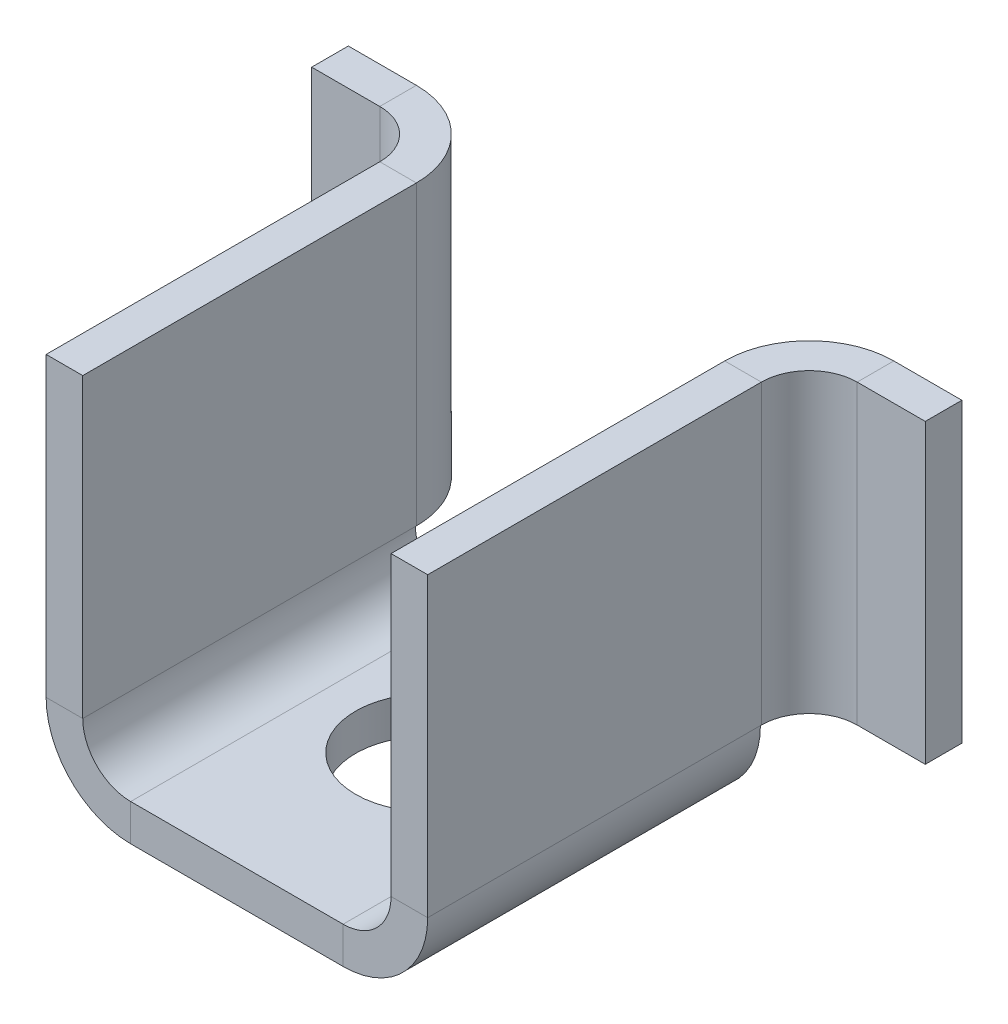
ISO-10303-21;
HEADER;
FILE_DESCRIPTION(('STEP AP214'),'2;1');
FILE_NAME('part.step','',(''),(''),'','','');
FILE_SCHEMA(('AUTOMOTIVE_DESIGN { 1 0 10303 214 1 1 1 1 }'));
ENDSEC;
DATA;
#1=APPLICATION_CONTEXT('core data for automotive mechanical design processes');
#2=APPLICATION_PROTOCOL_DEFINITION('international standard','automotive_design',2000,#1);
#3=PRODUCT_CONTEXT('',#1,'mechanical');
#4=PRODUCT('Part','Part','',(#3));
#5=PRODUCT_RELATED_PRODUCT_CATEGORY('part','',(#4));
#6=PRODUCT_DEFINITION_FORMATION('','',#4);
#7=PRODUCT_DEFINITION_CONTEXT('part definition',#1,'design');
#8=PRODUCT_DEFINITION('design','',#6,#7);
#9=PRODUCT_DEFINITION_SHAPE('','',#8);
#10=(LENGTH_UNIT() NAMED_UNIT(*) SI_UNIT(.MILLI.,.METRE.));
#11=(NAMED_UNIT(*) PLANE_ANGLE_UNIT() SI_UNIT($,.RADIAN.));
#12=(NAMED_UNIT(*) SI_UNIT($,.STERADIAN.) SOLID_ANGLE_UNIT());
#13=UNCERTAINTY_MEASURE_WITH_UNIT(LENGTH_MEASURE(1.E-05),#10,'distance_accuracy_value','');
#14=(GEOMETRIC_REPRESENTATION_CONTEXT(3) GLOBAL_UNCERTAINTY_ASSIGNED_CONTEXT((#13)) GLOBAL_UNIT_ASSIGNED_CONTEXT((#10,
#11,#12)) REPRESENTATION_CONTEXT('',''));
#15=CARTESIAN_POINT('',(0.,0.,0.));
#16=DIRECTION('',(0.,0.,1.));
#17=DIRECTION('',(1.,0.,0.));
#18=AXIS2_PLACEMENT_3D('',#15,#16,#17);
#19=CARTESIAN_POINT('',(-8.83920000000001,3.98780000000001,15.875));
#20=DIRECTION('',(0.,0.,1.));
#21=DIRECTION('',(-1.,0.,0.));
#22=AXIS2_PLACEMENT_3D('',#19,#20,#21);
#23=CYLINDRICAL_SURFACE('',#22,7.03579999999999);
#24=CARTESIAN_POINT('',(-8.83920000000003,3.98780000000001,-11.811));
#25=DIRECTION('',(0.,0.,1.));
#26=DIRECTION('',(1.,0.,0.));
#27=AXIS2_PLACEMENT_3D('',#24,#25,#26);
#28=CIRCLE('',#27,7.0358);
#29=CARTESIAN_POINT('',(-15.875,3.98780000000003,-11.811));
#30=VERTEX_POINT('',#29);
#31=CARTESIAN_POINT('',(-8.83920000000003,-3.048,-11.811));
#32=VERTEX_POINT('',#31);
#33=EDGE_CURVE('E436',#30,#32,#28,.T.);
#34=ORIENTED_EDGE('',*,*,#33,.T.);
#35=DIRECTION('',(0.,0.,1.));
#36=VECTOR('',#35,1.);
#37=CARTESIAN_POINT('',(-8.83920000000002,-3.04799999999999,15.875));
#38=LINE('',#37,#36);
#39=CARTESIAN_POINT('',(-8.83920000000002,-3.04799999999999,15.875));
#40=VERTEX_POINT('',#39);
#41=EDGE_CURVE('E274',#40,#32,#38,.F.);
#42=ORIENTED_EDGE('',*,*,#41,.F.);
#43=CARTESIAN_POINT('',(-8.83920000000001,3.98780000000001,15.875));
#44=DIRECTION('',(0.,0.,1.));
#45=DIRECTION('',(1.,0.,0.));
#46=AXIS2_PLACEMENT_3D('',#43,#44,#45);
#47=CIRCLE('',#46,7.03579999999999);
#48=CARTESIAN_POINT('',(-15.875,3.98779999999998,15.875));
#49=VERTEX_POINT('',#48);
#50=EDGE_CURVE('E317',#49,#40,#47,.T.);
#51=ORIENTED_EDGE('',*,*,#50,.F.);
#52=DIRECTION('',(0.,0.,1.));
#53=VECTOR('',#52,1.);
#54=CARTESIAN_POINT('',(-15.875,3.98779999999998,-15.875));
#55=LINE('',#54,#53);
#56=EDGE_CURVE('E307',#49,#30,#55,.F.);
#57=ORIENTED_EDGE('',*,*,#56,.T.);
#58=EDGE_LOOP('',(#34,#42,#51,#57));
#59=FACE_BOUND('',#58,.T.);
#60=ADVANCED_FACE('F76',(#59),#23,.T.);
#61=CARTESIAN_POINT('',(-8.83920000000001,3.98780000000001,15.875));
#62=DIRECTION('',(0.,0.,1.));
#63=DIRECTION('',(-1.,0.,0.));
#64=AXIS2_PLACEMENT_3D('',#61,#62,#63);
#65=CYLINDRICAL_SURFACE('',#64,3.98779999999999);
#66=DIRECTION('',(0.,0.,1.));
#67=VECTOR('',#66,1.);
#68=CARTESIAN_POINT('',(-8.83920000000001,0.,15.875));
#69=LINE('',#68,#67);
#70=CARTESIAN_POINT('',(-8.83920000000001,0.,15.875));
#71=VERTEX_POINT('',#70);
#72=CARTESIAN_POINT('',(-8.83920000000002,0.,-11.811));
#73=VERTEX_POINT('',#72);
#74=EDGE_CURVE('E320',#71,#73,#69,.F.);
#75=ORIENTED_EDGE('',*,*,#74,.T.);
#76=CARTESIAN_POINT('',(-8.83920000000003,3.98780000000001,-11.811));
#77=DIRECTION('',(0.,0.,-1.));
#78=DIRECTION('',(-1.,0.,0.));
#79=AXIS2_PLACEMENT_3D('',#76,#77,#78);
#80=CIRCLE('',#79,3.9878);
#81=CARTESIAN_POINT('',(-12.827,3.98780000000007,-11.811));
#82=VERTEX_POINT('',#81);
#83=EDGE_CURVE('E434',#82,#73,#80,.F.);
#84=ORIENTED_EDGE('',*,*,#83,.F.);
#85=DIRECTION('',(0.,0.,1.));
#86=VECTOR('',#85,1.);
#87=CARTESIAN_POINT('',(-12.827,3.98779999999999,-15.875));
#88=LINE('',#87,#86);
#89=CARTESIAN_POINT('',(-12.827,3.98779999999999,15.875));
#90=VERTEX_POINT('',#89);
#91=EDGE_CURVE('E294',#82,#90,#88,.T.);
#92=ORIENTED_EDGE('',*,*,#91,.T.);
#93=CARTESIAN_POINT('',(-8.83920000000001,3.98780000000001,15.875));
#94=DIRECTION('',(0.,0.,1.));
#95=DIRECTION('',(1.,0.,0.));
#96=AXIS2_PLACEMENT_3D('',#93,#94,#95);
#97=CIRCLE('',#96,3.98779999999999);
#98=EDGE_CURVE('E298',#90,#71,#97,.T.);
#99=ORIENTED_EDGE('',*,*,#98,.T.);
#100=EDGE_LOOP('',(#75,#84,#92,#99));
#101=FACE_BOUND('',#100,.T.);
#102=ADVANCED_FACE('F471',(#101),#65,.F.);
#103=CARTESIAN_POINT('',(8.83920000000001,3.9878,-15.875));
#104=DIRECTION('',(0.,0.,-1.));
#105=DIRECTION('',(1.,0.,0.));
#106=AXIS2_PLACEMENT_3D('',#103,#104,#105);
#107=CYLINDRICAL_SURFACE('',#106,7.0358);
#108=DIRECTION('',(0.,0.,-1.));
#109=VECTOR('',#108,1.);
#110=CARTESIAN_POINT('',(8.83920000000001,-3.048,-15.875));
#111=LINE('',#110,#109);
#112=CARTESIAN_POINT('',(8.83920000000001,-3.048,-11.811));
#113=VERTEX_POINT('',#112);
#114=CARTESIAN_POINT('',(8.83920000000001,-3.048,15.875));
#115=VERTEX_POINT('',#114);
#116=EDGE_CURVE('E272',#113,#115,#111,.F.);
#117=ORIENTED_EDGE('',*,*,#116,.F.);
#118=CARTESIAN_POINT('',(8.83920000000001,3.9878,-11.811));
#119=DIRECTION('',(0.,0.,1.));
#120=DIRECTION('',(1.,0.,0.));
#121=AXIS2_PLACEMENT_3D('',#118,#119,#120);
#122=CIRCLE('',#121,7.0358);
#123=CARTESIAN_POINT('',(15.875,3.9878,-11.811));
#124=VERTEX_POINT('',#123);
#125=EDGE_CURVE('E243',#113,#124,#122,.T.);
#126=ORIENTED_EDGE('',*,*,#125,.T.);
#127=DIRECTION('',(0.,0.,-1.));
#128=VECTOR('',#127,1.);
#129=CARTESIAN_POINT('',(15.875,3.98779999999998,15.875));
#130=LINE('',#129,#128);
#131=CARTESIAN_POINT('',(15.875,3.98779999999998,15.875));
#132=VERTEX_POINT('',#131);
#133=EDGE_CURVE('E372',#124,#132,#130,.F.);
#134=ORIENTED_EDGE('',*,*,#133,.T.);
#135=CARTESIAN_POINT('',(8.83920000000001,3.9878,15.875));
#136=DIRECTION('',(0.,0.,-1.));
#137=DIRECTION('',(-1.,0.,0.));
#138=AXIS2_PLACEMENT_3D('',#135,#136,#137);
#139=CIRCLE('',#138,7.0358);
#140=EDGE_CURVE('E278',#115,#132,#139,.F.);
#141=ORIENTED_EDGE('',*,*,#140,.F.);
#142=EDGE_LOOP('',(#117,#126,#134,#141));
#143=FACE_BOUND('',#142,.T.);
#144=ADVANCED_FACE('F276',(#143),#107,.T.);
#145=CARTESIAN_POINT('',(8.83920000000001,3.9878,-15.875));
#146=DIRECTION('',(0.,0.,-1.));
#147=DIRECTION('',(1.,0.,0.));
#148=AXIS2_PLACEMENT_3D('',#145,#146,#147);
#149=CYLINDRICAL_SURFACE('',#148,3.9878);
#150=CARTESIAN_POINT('',(8.83920000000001,3.9878,-11.811));
#151=DIRECTION('',(0.,0.,1.));
#152=DIRECTION('',(1.,0.,0.));
#153=AXIS2_PLACEMENT_3D('',#150,#151,#152);
#154=CIRCLE('',#153,3.9878);
#155=CARTESIAN_POINT('',(8.83920000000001,0.,-11.811));
#156=VERTEX_POINT('',#155);
#157=CARTESIAN_POINT('',(12.827,3.98780000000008,-11.811));
#158=VERTEX_POINT('',#157);
#159=EDGE_CURVE('E449',#156,#158,#154,.T.);
#160=ORIENTED_EDGE('',*,*,#159,.F.);
#161=DIRECTION('',(0.,0.,-1.));
#162=VECTOR('',#161,1.);
#163=CARTESIAN_POINT('',(8.83920000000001,0.,-15.875));
#164=LINE('',#163,#162);
#165=CARTESIAN_POINT('',(8.83920000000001,0.,15.875));
#166=VERTEX_POINT('',#165);
#167=EDGE_CURVE('E285',#156,#166,#164,.F.);
#168=ORIENTED_EDGE('',*,*,#167,.T.);
#169=CARTESIAN_POINT('',(8.83920000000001,3.9878,15.875));
#170=DIRECTION('',(0.,0.,-1.));
#171=DIRECTION('',(-1.,0.,0.));
#172=AXIS2_PLACEMENT_3D('',#169,#170,#171);
#173=CIRCLE('',#172,3.9878);
#174=CARTESIAN_POINT('',(12.827,3.98779999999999,15.875));
#175=VERTEX_POINT('',#174);
#176=EDGE_CURVE('E280',#166,#175,#173,.F.);
#177=ORIENTED_EDGE('',*,*,#176,.T.);
#178=DIRECTION('',(0.,0.,-1.));
#179=VECTOR('',#178,1.);
#180=CARTESIAN_POINT('',(12.827,3.98779999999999,15.875));
#181=LINE('',#180,#179);
#182=EDGE_CURVE('E373',#175,#158,#181,.T.);
#183=ORIENTED_EDGE('',*,*,#182,.T.);
#184=EDGE_LOOP('',(#160,#168,#177,#183));
#185=FACE_BOUND('',#184,.T.);
#186=ADVANCED_FACE('F564',(#185),#149,.F.);
#187=CARTESIAN_POINT('',(0.,-3.048,0.));
#188=DIRECTION('',(0.,-1.,0.));
#189=DIRECTION('',(0.,0.,-1.));
#190=AXIS2_PLACEMENT_3D('',#187,#188,#189);
#191=PLANE('',#190);
#192=CARTESIAN_POINT('',(0.,-3.048,0.));
#193=DIRECTION('',(0.,1.,0.));
#194=DIRECTION('',(0.,0.,1.));
#195=AXIS2_PLACEMENT_3D('',#192,#193,#194);
#196=CIRCLE('',#195,5.999999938);
#197=CARTESIAN_POINT('',(0.,-3.048,5.999999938));
#198=VERTEX_POINT('',#197);
#199=EDGE_CURVE('E328',#198,#198,#196,.T.);
#200=ORIENTED_EDGE('',*,*,#199,.T.);
#201=EDGE_LOOP('',(#200));
#202=FACE_BOUND('',#201,.T.);
#203=ORIENTED_EDGE('',*,*,#41,.T.);
#204=DIRECTION('',(1.,0.,0.));
#205=VECTOR('',#204,1.);
#206=CARTESIAN_POINT('',(0.,-3.048,-11.811));
#207=LINE('',#206,#205);
#208=EDGE_CURVE('E262',#113,#32,#207,.F.);
#209=ORIENTED_EDGE('',*,*,#208,.F.);
#210=ORIENTED_EDGE('',*,*,#116,.T.);
#211=DIRECTION('',(1.,0.,0.));
#212=VECTOR('',#211,1.);
#213=CARTESIAN_POINT('',(15.875,-3.048,15.875));
#214=LINE('',#213,#212);
#215=EDGE_CURVE('E87',#40,#115,#214,.T.);
#216=ORIENTED_EDGE('',*,*,#215,.F.);
#217=EDGE_LOOP('',(#203,#209,#210,#216));
#218=FACE_BOUND('',#217,.T.);
#219=ADVANCED_FACE('F270',(#202,#218),#191,.T.);
#220=CARTESIAN_POINT('',(0.,0.,0.));
#221=DIRECTION('',(0.,-1.,0.));
#222=DIRECTION('',(0.,0.,-1.));
#223=AXIS2_PLACEMENT_3D('',#220,#221,#222);
#224=PLANE('',#223);
#225=CARTESIAN_POINT('',(0.,0.,0.));
#226=DIRECTION('',(0.,1.,0.));
#227=DIRECTION('',(0.,0.,1.));
#228=AXIS2_PLACEMENT_3D('',#225,#226,#227);
#229=CIRCLE('',#228,5.999999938);
#230=CARTESIAN_POINT('',(0.,0.,5.999999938));
#231=VERTEX_POINT('',#230);
#232=EDGE_CURVE('E327',#231,#231,#229,.T.);
#233=ORIENTED_EDGE('',*,*,#232,.F.);
#234=EDGE_LOOP('',(#233));
#235=FACE_BOUND('',#234,.T.);
#236=DIRECTION('',(-1.,0.,0.));
#237=VECTOR('',#236,1.);
#238=CARTESIAN_POINT('',(0.,0.,-11.811));
#239=LINE('',#238,#237);
#240=EDGE_CURVE('E265',#156,#73,#239,.T.);
#241=ORIENTED_EDGE('',*,*,#240,.T.);
#242=ORIENTED_EDGE('',*,*,#74,.F.);
#243=DIRECTION('',(1.,0.,0.));
#244=VECTOR('',#243,1.);
#245=CARTESIAN_POINT('',(15.875,0.,15.875));
#246=LINE('',#245,#244);
#247=EDGE_CURVE('E331',#71,#166,#246,.T.);
#248=ORIENTED_EDGE('',*,*,#247,.T.);
#249=ORIENTED_EDGE('',*,*,#167,.F.);
#250=EDGE_LOOP('',(#241,#242,#248,#249));
#251=FACE_BOUND('',#250,.T.);
#252=ADVANCED_FACE('F467',(#235,#251),#224,.F.);
#253=CARTESIAN_POINT('',(15.875,0.,0.));
#254=DIRECTION('',(-1.,0.,0.));
#255=DIRECTION('',(0.,-1.,0.));
#256=AXIS2_PLACEMENT_3D('',#253,#254,#255);
#257=PLANE('',#256);
#258=DIRECTION('',(0.,1.,0.));
#259=VECTOR('',#258,1.);
#260=CARTESIAN_POINT('',(15.8750000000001,28.702,-11.8872));
#261=LINE('',#260,#259);
#262=CARTESIAN_POINT('',(15.8750000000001,28.702,-11.8872));
#263=VERTEX_POINT('',#262);
#264=CARTESIAN_POINT('',(15.875,3.98780000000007,-11.8872));
#265=VERTEX_POINT('',#264);
#266=EDGE_CURVE('E588',#263,#265,#261,.F.);
#267=ORIENTED_EDGE('',*,*,#266,.F.);
#268=DIRECTION('',(0.,0.,1.));
#269=VECTOR('',#268,1.);
#270=CARTESIAN_POINT('',(15.8750000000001,28.702,0.));
#271=LINE('',#270,#269);
#272=CARTESIAN_POINT('',(15.8750000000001,28.702,15.875));
#273=VERTEX_POINT('',#272);
#274=EDGE_CURVE('E361',#263,#273,#271,.T.);
#275=ORIENTED_EDGE('',*,*,#274,.T.);
#276=DIRECTION('',(0.,-1.,0.));
#277=VECTOR('',#276,1.);
#278=CARTESIAN_POINT('',(15.875,0.,15.875));
#279=LINE('',#278,#277);
#280=EDGE_CURVE('E363',#273,#132,#279,.T.);
#281=ORIENTED_EDGE('',*,*,#280,.T.);
#282=ORIENTED_EDGE('',*,*,#133,.F.);
#283=EDGE_CURVE('E371',#265,#124,#130,.F.);
#284=ORIENTED_EDGE('',*,*,#283,.F.);
#285=EDGE_LOOP('',(#267,#275,#281,#282,#284));
#286=FACE_BOUND('',#285,.T.);
#287=ADVANCED_FACE('F647',(#286),#257,.F.);
#288=CARTESIAN_POINT('',(12.827,0.,0.));
#289=DIRECTION('',(-1.,0.,0.));
#290=DIRECTION('',(0.,-1.,0.));
#291=AXIS2_PLACEMENT_3D('',#288,#289,#290);
#292=PLANE('',#291);
#293=DIRECTION('',(0.,0.,-1.));
#294=VECTOR('',#293,1.);
#295=CARTESIAN_POINT('',(12.8270000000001,28.702,15.875));
#296=LINE('',#295,#294);
#297=CARTESIAN_POINT('',(12.8270000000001,28.702,-11.8872));
#298=VERTEX_POINT('',#297);
#299=CARTESIAN_POINT('',(12.8270000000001,28.702,15.875));
#300=VERTEX_POINT('',#299);
#301=EDGE_CURVE('E366',#298,#300,#296,.F.);
#302=ORIENTED_EDGE('',*,*,#301,.F.);
#303=DIRECTION('',(0.,1.,0.));
#304=VECTOR('',#303,1.);
#305=CARTESIAN_POINT('',(12.8270000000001,28.702,-11.8872));
#306=LINE('',#305,#304);
#307=CARTESIAN_POINT('',(12.827,3.98780000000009,-11.8872));
#308=VERTEX_POINT('',#307);
#309=EDGE_CURVE('E574',#298,#308,#306,.F.);
#310=ORIENTED_EDGE('',*,*,#309,.T.);
#311=DIRECTION('',(0.,0.,-1.));
#312=VECTOR('',#311,1.);
#313=CARTESIAN_POINT('',(12.827,3.98780000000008,-15.875));
#314=LINE('',#313,#312);
#315=EDGE_CURVE('E419',#308,#158,#314,.F.);
#316=ORIENTED_EDGE('',*,*,#315,.T.);
#317=ORIENTED_EDGE('',*,*,#182,.F.);
#318=DIRECTION('',(0.,1.,0.));
#319=VECTOR('',#318,1.);
#320=CARTESIAN_POINT('',(12.827,0.,15.875));
#321=LINE('',#320,#319);
#322=EDGE_CURVE('E368',#300,#175,#321,.F.);
#323=ORIENTED_EDGE('',*,*,#322,.F.);
#324=EDGE_LOOP('',(#302,#310,#316,#317,#323));
#325=FACE_BOUND('',#324,.T.);
#326=ADVANCED_FACE('F567',(#325),#292,.T.);
#327=CARTESIAN_POINT('',(15.8750000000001,28.702,15.875));
#328=DIRECTION('',(0.,-1.,0.));
#329=DIRECTION('',(1.,0.,0.));
#330=AXIS2_PLACEMENT_3D('',#327,#328,#329);
#331=PLANE('',#330);
#332=DIRECTION('',(-1.,0.,0.));
#333=VECTOR('',#332,1.);
#334=CARTESIAN_POINT('',(15.8750000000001,28.702,-11.8872));
#335=LINE('',#334,#333);
#336=EDGE_CURVE('E510',#263,#298,#335,.T.);
#337=ORIENTED_EDGE('',*,*,#336,.T.);
#338=ORIENTED_EDGE('',*,*,#301,.T.);
#339=DIRECTION('',(-1.,0.,0.));
#340=VECTOR('',#339,1.);
#341=CARTESIAN_POINT('',(15.8750000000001,28.702,15.875));
#342=LINE('',#341,#340);
#343=EDGE_CURVE('E292',#273,#300,#342,.T.);
#344=ORIENTED_EDGE('',*,*,#343,.F.);
#345=ORIENTED_EDGE('',*,*,#274,.F.);
#346=EDGE_LOOP('',(#337,#338,#344,#345));
#347=FACE_BOUND('',#346,.T.);
#348=ADVANCED_FACE('F572',(#347),#331,.F.);
#349=CARTESIAN_POINT('',(-15.875,0.,0.));
#350=DIRECTION('',(1.,0.,0.));
#351=DIRECTION('',(0.,1.,0.));
#352=AXIS2_PLACEMENT_3D('',#349,#350,#351);
#353=PLANE('',#352);
#354=DIRECTION('',(0.,-1.,0.));
#355=VECTOR('',#354,1.);
#356=CARTESIAN_POINT('',(-15.875,3.98779999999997,-11.8872));
#357=LINE('',#356,#355);
#358=CARTESIAN_POINT('',(-15.875,3.98780000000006,-11.8872));
#359=VERTEX_POINT('',#358);
#360=CARTESIAN_POINT('',(-15.8750000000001,28.702,-11.8872));
#361=VERTEX_POINT('',#360);
#362=EDGE_CURVE('E350',#359,#361,#357,.F.);
#363=ORIENTED_EDGE('',*,*,#362,.F.);
#364=DIRECTION('',(0.,0.,1.));
#365=VECTOR('',#364,1.);
#366=CARTESIAN_POINT('',(-15.875,3.98780000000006,15.875));
#367=LINE('',#366,#365);
#368=EDGE_CURVE('E447',#30,#359,#367,.F.);
#369=ORIENTED_EDGE('',*,*,#368,.F.);
#370=ORIENTED_EDGE('',*,*,#56,.F.);
#371=DIRECTION('',(0.,1.,0.));
#372=VECTOR('',#371,1.);
#373=CARTESIAN_POINT('',(-15.875,0.,15.875));
#374=LINE('',#373,#372);
#375=CARTESIAN_POINT('',(-15.8750000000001,28.702,15.875));
#376=VERTEX_POINT('',#375);
#377=EDGE_CURVE('E301',#49,#376,#374,.T.);
#378=ORIENTED_EDGE('',*,*,#377,.T.);
#379=DIRECTION('',(0.,0.,-1.));
#380=VECTOR('',#379,1.);
#381=CARTESIAN_POINT('',(-15.8750000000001,28.702,0.));
#382=LINE('',#381,#380);
#383=EDGE_CURVE('E299',#376,#361,#382,.T.);
#384=ORIENTED_EDGE('',*,*,#383,.T.);
#385=EDGE_LOOP('',(#363,#369,#370,#378,#384));
#386=FACE_BOUND('',#385,.T.);
#387=ADVANCED_FACE('F492',(#386),#353,.F.);
#388=CARTESIAN_POINT('',(-12.827,0.,0.));
#389=DIRECTION('',(1.,0.,0.));
#390=DIRECTION('',(0.,1.,0.));
#391=AXIS2_PLACEMENT_3D('',#388,#389,#390);
#392=PLANE('',#391);
#393=CARTESIAN_POINT('',(-12.827,3.98780000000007,-11.8872));
#394=VERTEX_POINT('',#393);
#395=EDGE_CURVE('E313',#394,#82,#88,.T.);
#396=ORIENTED_EDGE('',*,*,#395,.F.);
#397=DIRECTION('',(0.,-1.,0.));
#398=VECTOR('',#397,1.);
#399=CARTESIAN_POINT('',(-12.827,3.98779999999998,-11.8872));
#400=LINE('',#399,#398);
#401=CARTESIAN_POINT('',(-12.8270000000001,28.702,-11.8872));
#402=VERTEX_POINT('',#401);
#403=EDGE_CURVE('E349',#394,#402,#400,.F.);
#404=ORIENTED_EDGE('',*,*,#403,.T.);
#405=DIRECTION('',(0.,0.,1.));
#406=VECTOR('',#405,1.);
#407=CARTESIAN_POINT('',(-12.8270000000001,28.702,-15.875));
#408=LINE('',#407,#406);
#409=CARTESIAN_POINT('',(-12.8270000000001,28.702,15.875));
#410=VERTEX_POINT('',#409);
#411=EDGE_CURVE('E303',#410,#402,#408,.F.);
#412=ORIENTED_EDGE('',*,*,#411,.F.);
#413=DIRECTION('',(0.,-1.,0.));
#414=VECTOR('',#413,1.);
#415=CARTESIAN_POINT('',(-12.8270000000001,28.702,15.875));
#416=LINE('',#415,#414);
#417=EDGE_CURVE('E305',#90,#410,#416,.F.);
#418=ORIENTED_EDGE('',*,*,#417,.F.);
#419=ORIENTED_EDGE('',*,*,#91,.F.);
#420=EDGE_LOOP('',(#396,#404,#412,#418,#419));
#421=FACE_BOUND('',#420,.T.);
#422=ADVANCED_FACE('F486',(#421),#392,.T.);
#423=CARTESIAN_POINT('',(-15.8750000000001,28.702,-15.875));
#424=DIRECTION('',(0.,-1.,0.));
#425=DIRECTION('',(1.,0.,0.));
#426=AXIS2_PLACEMENT_3D('',#423,#424,#425);
#427=PLANE('',#426);
#428=DIRECTION('',(1.,0.,0.));
#429=VECTOR('',#428,1.);
#430=CARTESIAN_POINT('',(-15.8750000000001,28.702,-11.8872));
#431=LINE('',#430,#429);
#432=EDGE_CURVE('E104',#361,#402,#431,.T.);
#433=ORIENTED_EDGE('',*,*,#432,.F.);
#434=ORIENTED_EDGE('',*,*,#383,.F.);
#435=DIRECTION('',(1.,0.,0.));
#436=VECTOR('',#435,1.);
#437=CARTESIAN_POINT('',(-15.8750000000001,28.702,15.875));
#438=LINE('',#437,#436);
#439=EDGE_CURVE('E295',#376,#410,#438,.T.);
#440=ORIENTED_EDGE('',*,*,#439,.T.);
#441=ORIENTED_EDGE('',*,*,#411,.T.);
#442=EDGE_LOOP('',(#433,#434,#440,#441));
#443=FACE_BOUND('',#442,.T.);
#444=ADVANCED_FACE('F489',(#443),#427,.F.);
#445=CARTESIAN_POINT('',(15.875,-3.048,15.875));
#446=DIRECTION('',(0.,0.,1.));
#447=DIRECTION('',(1.,0.,0.));
#448=AXIS2_PLACEMENT_3D('',#445,#446,#447);
#449=PLANE('',#448);
#450=DIRECTION('',(0.,-1.,0.));
#451=VECTOR('',#450,1.);
#452=CARTESIAN_POINT('',(8.83920000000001,0.,15.875));
#453=LINE('',#452,#451);
#454=EDGE_CURVE('E282',#166,#115,#453,.T.);
#455=ORIENTED_EDGE('',*,*,#454,.F.);
#456=ORIENTED_EDGE('',*,*,#247,.F.);
#457=DIRECTION('',(0.,-1.,0.));
#458=VECTOR('',#457,1.);
#459=CARTESIAN_POINT('',(-8.83920000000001,0.,15.875));
#460=LINE('',#459,#458);
#461=EDGE_CURVE('E316',#71,#40,#460,.T.);
#462=ORIENTED_EDGE('',*,*,#461,.T.);
#463=ORIENTED_EDGE('',*,*,#215,.T.);
#464=EDGE_LOOP('',(#455,#456,#462,#463));
#465=FACE_BOUND('',#464,.T.);
#466=ADVANCED_FACE('F78',(#465),#449,.T.);
#467=CARTESIAN_POINT('',(0.,-3.048,0.));
#468=DIRECTION('',(0.,1.,0.));
#469=DIRECTION('',(0.,0.,1.));
#470=AXIS2_PLACEMENT_3D('',#467,#468,#469);
#471=CYLINDRICAL_SURFACE('',#470,5.999999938);
#472=CARTESIAN_POINT('',(0.,-3.048,5.999999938));
#473=CARTESIAN_POINT('',(0.,-3.01625,5.999999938));
#474=CARTESIAN_POINT('',(0.,-2.9845,5.999999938));
#475=CARTESIAN_POINT('',(0.,-2.921,5.999999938));
#476=CARTESIAN_POINT('',(0.,-2.88925,5.999999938));
#477=CARTESIAN_POINT('',(0.,-2.82575,5.999999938));
#478=CARTESIAN_POINT('',(0.,-2.794,5.999999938));
#479=CARTESIAN_POINT('',(0.,-2.7305,5.999999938));
#480=CARTESIAN_POINT('',(0.,-2.69875,5.999999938));
#481=CARTESIAN_POINT('',(0.,-2.63525,5.999999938));
#482=CARTESIAN_POINT('',(0.,-2.6035,5.999999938));
#483=CARTESIAN_POINT('',(0.,-2.54,5.999999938));
#484=CARTESIAN_POINT('',(0.,-2.50825,5.999999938));
#485=CARTESIAN_POINT('',(0.,-2.44475,5.999999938));
#486=CARTESIAN_POINT('',(0.,-2.413,5.999999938));
#487=CARTESIAN_POINT('',(0.,-2.3495,5.999999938));
#488=CARTESIAN_POINT('',(0.,-2.31775,5.999999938));
#489=CARTESIAN_POINT('',(0.,-2.25425,5.999999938));
#490=CARTESIAN_POINT('',(0.,-2.2225,5.999999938));
#491=CARTESIAN_POINT('',(0.,-2.159,5.999999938));
#492=CARTESIAN_POINT('',(0.,-2.12725,5.999999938));
#493=CARTESIAN_POINT('',(0.,-2.06375,5.999999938));
#494=CARTESIAN_POINT('',(0.,-2.032,5.999999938));
#495=CARTESIAN_POINT('',(0.,-1.9685,5.999999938));
#496=CARTESIAN_POINT('',(0.,-1.93675,5.999999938));
#497=CARTESIAN_POINT('',(0.,-1.87325,5.999999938));
#498=CARTESIAN_POINT('',(0.,-1.8415,5.999999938));
#499=CARTESIAN_POINT('',(0.,-1.778,5.999999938));
#500=CARTESIAN_POINT('',(0.,-1.74625,5.999999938));
#501=CARTESIAN_POINT('',(0.,-1.68275,5.999999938));
#502=CARTESIAN_POINT('',(0.,-1.651,5.999999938));
#503=CARTESIAN_POINT('',(0.,-1.5875,5.999999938));
#504=CARTESIAN_POINT('',(0.,-1.55575,5.999999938));
#505=CARTESIAN_POINT('',(0.,-1.49225,5.999999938));
#506=CARTESIAN_POINT('',(0.,-1.4605,5.999999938));
#507=CARTESIAN_POINT('',(0.,-1.397,5.999999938));
#508=CARTESIAN_POINT('',(0.,-1.36525,5.999999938));
#509=CARTESIAN_POINT('',(0.,-1.30175,5.999999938));
#510=CARTESIAN_POINT('',(0.,-1.27,5.999999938));
#511=CARTESIAN_POINT('',(0.,-1.2065,5.999999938));
#512=CARTESIAN_POINT('',(0.,-1.17475,5.999999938));
#513=CARTESIAN_POINT('',(0.,-1.11125,5.999999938));
#514=CARTESIAN_POINT('',(0.,-1.0795,5.999999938));
#515=CARTESIAN_POINT('',(0.,-1.016,5.999999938));
#516=CARTESIAN_POINT('',(0.,-0.98425,5.999999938));
#517=CARTESIAN_POINT('',(0.,-0.92075,5.999999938));
#518=CARTESIAN_POINT('',(0.,-0.889,5.999999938));
#519=CARTESIAN_POINT('',(0.,-0.8255,5.999999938));
#520=CARTESIAN_POINT('',(0.,-0.79375,5.999999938));
#521=CARTESIAN_POINT('',(0.,-0.73025,5.999999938));
#522=CARTESIAN_POINT('',(0.,-0.6985,5.999999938));
#523=CARTESIAN_POINT('',(0.,-0.635,5.999999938));
#524=CARTESIAN_POINT('',(0.,-0.60325,5.999999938));
#525=CARTESIAN_POINT('',(0.,-0.53975,5.999999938));
#526=CARTESIAN_POINT('',(0.,-0.508,5.999999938));
#527=CARTESIAN_POINT('',(0.,-0.4445,5.999999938));
#528=CARTESIAN_POINT('',(0.,-0.41275,5.999999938));
#529=CARTESIAN_POINT('',(0.,-0.34925,5.999999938));
#530=CARTESIAN_POINT('',(0.,-0.3175,5.999999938));
#531=CARTESIAN_POINT('',(0.,-0.254,5.999999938));
#532=CARTESIAN_POINT('',(0.,-0.22225,5.999999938));
#533=CARTESIAN_POINT('',(0.,-0.15875,5.999999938));
#534=CARTESIAN_POINT('',(0.,-0.127,5.999999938));
#535=CARTESIAN_POINT('',(0.,-0.0634999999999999,5.999999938));
#536=CARTESIAN_POINT('',(0.,-0.03175,5.999999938));
#537=CARTESIAN_POINT('',(0.,0.,5.999999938));
#538=B_SPLINE_CURVE_WITH_KNOTS('',3,(#472,#473,#474,#475,#476,#477,#478,#479,#480,#481,#482,
#483,#484,#485,#486,#487,#488,#489,#490,#491,#492,#493,#494,#495,#496,#497,#498,#499,#500,#501,
#502,#503,#504,#505,#506,#507,#508,#509,#510,#511,#512,#513,#514,#515,#516,#517,#518,#519,#520,
#521,#522,#523,#524,#525,#526,#527,#528,#529,#530,#531,#532,#533,#534,#535,#536,#537),
.UNSPECIFIED.,.F.,.F.,(4,2,2,2,2,2,2,2,2,2,2,2,2,2,2,2,2,2,2,2,2,2,2,2,2,2,2,2,2,2,2,2,4),(0.,
0.0952499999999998,0.1905,0.28575,0.381,0.47625,0.5715,0.66675,0.762,0.85725,0.9525,1.04775,
1.143,1.23825,1.3335,1.42875,1.524,1.61925,1.7145,1.80975,1.905,2.00025,2.0955,2.19075,2.286,
2.38125,2.4765,2.57175,2.667,2.76225,2.8575,2.95275,3.048),.UNSPECIFIED.);
#539=EDGE_CURVE('BSEAM669',#198,#231,#538,.T.);
#540=ORIENTED_EDGE('',*,*,#199,.F.);
#541=ORIENTED_EDGE('',*,*,#232,.T.);
#542=ORIENTED_EDGE('',*,*,#539,.T.);
#543=ORIENTED_EDGE('',*,*,#539,.F.);
#544=EDGE_LOOP('',(#540,#542,#541,#543));
#545=FACE_BOUND('',#544,.T.);
#546=ADVANCED_FACE('F669',(#545),#471,.F.);
#547=CARTESIAN_POINT('',(-8.83920000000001,3.98780000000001,15.875));
#548=DIRECTION('',(0.,0.,-1.));
#549=DIRECTION('',(-1.,0.,0.));
#550=AXIS2_PLACEMENT_3D('',#547,#548,#549);
#551=PLANE('',#550);
#552=ORIENTED_EDGE('',*,*,#98,.F.);
#553=DIRECTION('',(1.,0.,0.));
#554=VECTOR('',#553,1.);
#555=CARTESIAN_POINT('',(-12.827,3.98779999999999,15.875));
#556=LINE('',#555,#554);
#557=EDGE_CURVE('E310',#90,#49,#556,.F.);
#558=ORIENTED_EDGE('',*,*,#557,.T.);
#559=ORIENTED_EDGE('',*,*,#50,.T.);
#560=ORIENTED_EDGE('',*,*,#461,.F.);
#561=EDGE_LOOP('',(#552,#558,#559,#560));
#562=FACE_BOUND('',#561,.T.);
#563=ADVANCED_FACE('F476',(#562),#551,.F.);
#564=CARTESIAN_POINT('',(-15.8750000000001,28.702,15.875));
#565=DIRECTION('',(0.,0.,-1.));
#566=DIRECTION('',(-1.,0.,0.));
#567=AXIS2_PLACEMENT_3D('',#564,#565,#566);
#568=PLANE('',#567);
#569=ORIENTED_EDGE('',*,*,#557,.F.);
#570=ORIENTED_EDGE('',*,*,#417,.T.);
#571=ORIENTED_EDGE('',*,*,#439,.F.);
#572=ORIENTED_EDGE('',*,*,#377,.F.);
#573=EDGE_LOOP('',(#569,#570,#571,#572));
#574=FACE_BOUND('',#573,.T.);
#575=ADVANCED_FACE('F481',(#574),#568,.F.);
#576=CARTESIAN_POINT('',(8.83920000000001,3.9878,15.875));
#577=DIRECTION('',(0.,0.,1.));
#578=DIRECTION('',(1.,0.,0.));
#579=AXIS2_PLACEMENT_3D('',#576,#577,#578);
#580=PLANE('',#579);
#581=DIRECTION('',(-1.,0.,0.));
#582=VECTOR('',#581,1.);
#583=CARTESIAN_POINT('',(15.875,3.98779999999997,15.875));
#584=LINE('',#583,#582);
#585=EDGE_CURVE('E288',#175,#132,#584,.F.);
#586=ORIENTED_EDGE('',*,*,#585,.F.);
#587=ORIENTED_EDGE('',*,*,#176,.F.);
#588=ORIENTED_EDGE('',*,*,#454,.T.);
#589=ORIENTED_EDGE('',*,*,#140,.T.);
#590=EDGE_LOOP('',(#586,#587,#588,#589));
#591=FACE_BOUND('',#590,.T.);
#592=ADVANCED_FACE('F563',(#591),#580,.T.);
#593=CARTESIAN_POINT('',(15.875,0.,15.875));
#594=DIRECTION('',(0.,0.,-1.));
#595=DIRECTION('',(-1.,0.,0.));
#596=AXIS2_PLACEMENT_3D('',#593,#594,#595);
#597=PLANE('',#596);
#598=ORIENTED_EDGE('',*,*,#585,.T.);
#599=ORIENTED_EDGE('',*,*,#280,.F.);
#600=ORIENTED_EDGE('',*,*,#343,.T.);
#601=ORIENTED_EDGE('',*,*,#322,.T.);
#602=EDGE_LOOP('',(#598,#599,#600,#601));
#603=FACE_BOUND('',#602,.T.);
#604=ADVANCED_FACE('F568',(#603),#597,.F.);
#605=CARTESIAN_POINT('',(-19.8628000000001,28.702,-11.8872));
#606=DIRECTION('',(0.,1.,0.));
#607=DIRECTION('',(-1.,0.,0.));
#608=AXIS2_PLACEMENT_3D('',#605,#606,#607);
#609=PLANE('',#608);
#610=DIRECTION('',(0.,0.,-1.));
#611=VECTOR('',#610,1.);
#612=CARTESIAN_POINT('',(-19.8628000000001,28.702,-15.875));
#613=LINE('',#612,#611);
#614=CARTESIAN_POINT('',(-19.8628000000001,28.702,-15.875));
#615=VERTEX_POINT('',#614);
#616=CARTESIAN_POINT('',(-19.8628000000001,28.702,-18.923));
#617=VERTEX_POINT('',#616);
#618=EDGE_CURVE('E504',#615,#617,#613,.T.);
#619=ORIENTED_EDGE('',*,*,#618,.F.);
#620=CARTESIAN_POINT('',(-19.8628000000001,28.702,-11.8872));
#621=DIRECTION('',(0.,-1.,0.));
#622=DIRECTION('',(1.,0.,0.));
#623=AXIS2_PLACEMENT_3D('',#620,#621,#622);
#624=CIRCLE('',#623,3.9878);
#625=EDGE_CURVE('E346',#361,#615,#624,.F.);
#626=ORIENTED_EDGE('',*,*,#625,.F.);
#627=ORIENTED_EDGE('',*,*,#432,.T.);
#628=CARTESIAN_POINT('',(-19.8628000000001,28.702,-11.8872));
#629=DIRECTION('',(0.,-1.,0.));
#630=DIRECTION('',(1.,0.,0.));
#631=AXIS2_PLACEMENT_3D('',#628,#629,#630);
#632=CIRCLE('',#631,7.0358);
#633=EDGE_CURVE('E344',#402,#617,#632,.F.);
#634=ORIENTED_EDGE('',*,*,#633,.T.);
#635=EDGE_LOOP('',(#619,#626,#627,#634));
#636=FACE_BOUND('',#635,.T.);
#637=ADVANCED_FACE('F500',(#636),#609,.T.);
#638=CARTESIAN_POINT('',(-19.8628,3.98779999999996,-11.8872));
#639=DIRECTION('',(0.,1.,0.));
#640=DIRECTION('',(-1.,0.,0.));
#641=AXIS2_PLACEMENT_3D('',#638,#639,#640);
#642=PLANE('',#641);
#643=DIRECTION('',(0.,0.,-1.));
#644=VECTOR('',#643,1.);
#645=CARTESIAN_POINT('',(-19.8628,3.98779999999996,-15.875));
#646=LINE('',#645,#644);
#647=CARTESIAN_POINT('',(-19.8628,3.98779999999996,-15.875));
#648=VERTEX_POINT('',#647);
#649=CARTESIAN_POINT('',(-19.8628,3.98779999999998,-18.923));
#650=VERTEX_POINT('',#649);
#651=EDGE_CURVE('E512',#648,#650,#646,.T.);
#652=ORIENTED_EDGE('',*,*,#651,.T.);
#653=CARTESIAN_POINT('',(-19.8628,3.98779999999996,-11.8872));
#654=DIRECTION('',(0.,-1.,0.));
#655=DIRECTION('',(1.,0.,0.));
#656=AXIS2_PLACEMENT_3D('',#653,#654,#655);
#657=CIRCLE('',#656,7.0358);
#658=CARTESIAN_POINT('',(-13.6747137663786,3.98779999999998,-15.2353443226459));
#659=VERTEX_POINT('',#658);
#660=EDGE_CURVE('E13',#650,#659,#657,.T.);
#661=ORIENTED_EDGE('',*,*,#660,.T.);
#662=DIRECTION('',(1.,0.,0.));
#663=VECTOR('',#662,1.);
#664=CARTESIAN_POINT('',(-12.827,3.98780000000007,-15.235344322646));
#665=LINE('',#664,#663);
#666=CARTESIAN_POINT('',(-15.875,3.98780000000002,-15.2353443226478));
#667=VERTEX_POINT('',#666);
#668=EDGE_CURVE('E386',#659,#667,#665,.F.);
#669=ORIENTED_EDGE('',*,*,#668,.T.);
#670=CARTESIAN_POINT('',(-15.875,3.98780000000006,-14.5576458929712));
#671=CARTESIAN_POINT('',(-15.875,3.98964462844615,-14.8206204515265));
#672=CARTESIAN_POINT('',(-15.875,3.99148925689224,-15.0835950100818));
#673=CARTESIAN_POINT('',(-15.875,3.98780000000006,-15.235344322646));
#674=B_SPLINE_CURVE_WITH_KNOTS('',3,(#670,#671,#672,#673),.UNSPECIFIED.,.F.,.F.,(4,4),
(0.835471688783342,1.),.UNSPECIFIED.);
#675=CARTESIAN_POINT('',(-15.875,3.98780000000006,-14.5576458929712));
#676=VERTEX_POINT('',#675);
#677=EDGE_CURVE('E358',#667,#676,#674,.F.);
#678=ORIENTED_EDGE('',*,*,#677,.T.);
#679=DIRECTION('',(1.,0.,0.));
#680=VECTOR('',#679,1.);
#681=CARTESIAN_POINT('',(-12.827,3.98780000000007,-14.5576458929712));
#682=LINE('',#681,#680);
#683=CARTESIAN_POINT('',(-13.3534835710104,3.98779999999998,-14.5576458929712));
#684=VERTEX_POINT('',#683);
#685=EDGE_CURVE('E384',#684,#676,#682,.F.);
#686=ORIENTED_EDGE('',*,*,#685,.F.);
#687=CARTESIAN_POINT('',(-19.8628,3.98779999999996,-11.8872));
#688=DIRECTION('',(0.,1.,0.));
#689=DIRECTION('',(-1.,0.,0.));
#690=AXIS2_PLACEMENT_3D('',#687,#688,#689);
#691=CIRCLE('',#690,7.0358);
#692=EDGE_CURVE('E450',#684,#394,#691,.F.);
#693=ORIENTED_EDGE('',*,*,#692,.T.);
#694=DIRECTION('',(-1.,0.,0.));
#695=VECTOR('',#694,1.);
#696=CARTESIAN_POINT('',(-15.875,3.98780000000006,-11.8872));
#697=LINE('',#696,#695);
#698=EDGE_CURVE('E442',#359,#394,#697,.F.);
#699=ORIENTED_EDGE('',*,*,#698,.F.);
#700=CARTESIAN_POINT('',(-19.8628,3.98779999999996,-11.8872));
#701=DIRECTION('',(0.,-1.,0.));
#702=DIRECTION('',(1.,0.,0.));
#703=AXIS2_PLACEMENT_3D('',#700,#701,#702);
#704=CIRCLE('',#703,3.9878);
#705=EDGE_CURVE('E353',#648,#359,#704,.T.);
#706=ORIENTED_EDGE('',*,*,#705,.F.);
#707=EDGE_LOOP('',(#652,#661,#669,#678,#686,#693,#699,#706));
#708=FACE_BOUND('',#707,.T.);
#709=ADVANCED_FACE('F383',(#708),#642,.F.);
#710=CARTESIAN_POINT('',(-19.8628,3.98779999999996,-11.8872));
#711=DIRECTION('',(0.,-1.,0.));
#712=DIRECTION('',(0.,0.,-1.));
#713=AXIS2_PLACEMENT_3D('',#710,#711,#712);
#714=CYLINDRICAL_SURFACE('',#713,7.0358);
#715=ORIENTED_EDGE('',*,*,#403,.F.);
#716=ORIENTED_EDGE('',*,*,#692,.F.);
#717=CARTESIAN_POINT('',(-13.6747137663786,3.98780000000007,-15.2353443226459));
#718=CARTESIAN_POINT('',(-13.6648778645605,3.98822733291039,-15.2173172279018));
#719=CARTESIAN_POINT('',(-13.6551012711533,3.98856188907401,-15.1992548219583));
#720=CARTESIAN_POINT('',(-13.6325572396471,3.9891793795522,-15.1571236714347));
#721=CARTESIAN_POINT('',(-13.6198553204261,3.98940980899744,-15.1330190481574));
#722=CARTESIAN_POINT('',(-13.5914724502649,3.9897825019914,-15.0779780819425));
#723=CARTESIAN_POINT('',(-13.5759247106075,3.98988353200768,-15.0469728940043));
#724=CARTESIAN_POINT('',(-13.5417472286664,3.98995880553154,-14.9776630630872));
#725=CARTESIAN_POINT('',(-13.5232233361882,3.98989887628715,-14.939306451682));
#726=CARTESIAN_POINT('',(-13.4860683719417,3.98965703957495,-14.8604827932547));
#727=CARTESIAN_POINT('',(-13.4674713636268,3.98946966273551,-14.8199996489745));
#728=CARTESIAN_POINT('',(-13.4344250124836,3.98906361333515,-14.7462186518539));
#729=CARTESIAN_POINT('',(-13.4198454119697,3.9888571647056,-14.7129787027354));
#730=CARTESIAN_POINT('',(-13.3946619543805,3.98847553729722,-14.6549352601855));
#731=CARTESIAN_POINT('',(-13.3839986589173,3.98830594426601,-14.6301574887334));
#732=CARTESIAN_POINT('',(-13.3667480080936,3.98802312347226,-14.589455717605));
#733=CARTESIAN_POINT('',(-13.3600794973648,3.98791166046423,-14.5735660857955));
#734=CARTESIAN_POINT('',(-13.3534835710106,3.98780000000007,-14.5576458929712));
#735=B_SPLINE_CURVE_WITH_KNOTS('',3,(#717,#718,#719,#720,#721,#722,#723,#724,#725,#726,#727,
#728,#729,#730,#731,#732,#733,#734),.UNSPECIFIED.,.F.,.F.,(4,2,2,2,2,2,2,2,4),(0.,
0.0616218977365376,0.143360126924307,0.247409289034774,0.375189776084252,0.508831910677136,
0.617722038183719,0.698647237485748,0.750344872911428),.UNSPECIFIED.);
#736=EDGE_CURVE('E95',#659,#684,#735,.T.);
#737=ORIENTED_EDGE('',*,*,#736,.F.);
#738=ORIENTED_EDGE('',*,*,#660,.F.);
#739=DIRECTION('',(0.,1.,0.));
#740=VECTOR('',#739,1.);
#741=CARTESIAN_POINT('',(-19.8628,0.,-18.923));
#742=LINE('',#741,#740);
#743=EDGE_CURVE('E519',#650,#617,#742,.T.);
#744=ORIENTED_EDGE('',*,*,#743,.T.);
#745=ORIENTED_EDGE('',*,*,#633,.F.);
#746=EDGE_LOOP('',(#715,#716,#737,#738,#744,#745));
#747=FACE_BOUND('',#746,.T.);
#748=ADVANCED_FACE('F734',(#747),#714,.T.);
#749=CARTESIAN_POINT('',(-19.8628,3.98779999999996,-11.8872));
#750=DIRECTION('',(0.,-1.,0.));
#751=DIRECTION('',(0.,0.,-1.));
#752=AXIS2_PLACEMENT_3D('',#749,#750,#751);
#753=CYLINDRICAL_SURFACE('',#752,3.9878);
#754=ORIENTED_EDGE('',*,*,#362,.T.);
#755=ORIENTED_EDGE('',*,*,#625,.T.);
#756=DIRECTION('',(0.,-1.,0.));
#757=VECTOR('',#756,1.);
#758=CARTESIAN_POINT('',(-19.8628000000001,28.702,-15.875));
#759=LINE('',#758,#757);
#760=EDGE_CURVE('E509',#615,#648,#759,.T.);
#761=ORIENTED_EDGE('',*,*,#760,.T.);
#762=ORIENTED_EDGE('',*,*,#705,.T.);
#763=EDGE_LOOP('',(#754,#755,#761,#762));
#764=FACE_BOUND('',#763,.T.);
#765=ADVANCED_FACE('F496',(#764),#753,.F.);
#766=CARTESIAN_POINT('',(-15.8750000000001,28.702,-18.923));
#767=DIRECTION('',(0.,-1.,0.));
#768=DIRECTION('',(1.,0.,0.));
#769=AXIS2_PLACEMENT_3D('',#766,#767,#768);
#770=PLANE('',#769);
#771=ORIENTED_EDGE('',*,*,#618,.T.);
#772=DIRECTION('',(1.,0.,0.));
#773=VECTOR('',#772,1.);
#774=CARTESIAN_POINT('',(-15.8750000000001,28.702,-18.923));
#775=LINE('',#774,#773);
#776=CARTESIAN_POINT('',(-25.5270000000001,28.702,-18.923));
#777=VERTEX_POINT('',#776);
#778=EDGE_CURVE('E522',#777,#617,#775,.T.);
#779=ORIENTED_EDGE('',*,*,#778,.F.);
#780=DIRECTION('',(0.,0.,1.));
#781=VECTOR('',#780,1.);
#782=CARTESIAN_POINT('',(-25.5270000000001,28.702,-18.923));
#783=LINE('',#782,#781);
#784=CARTESIAN_POINT('',(-25.5270000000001,28.702,-15.875));
#785=VERTEX_POINT('',#784);
#786=EDGE_CURVE('E529',#777,#785,#783,.T.);
#787=ORIENTED_EDGE('',*,*,#786,.T.);
#788=DIRECTION('',(1.,0.,0.));
#789=VECTOR('',#788,1.);
#790=CARTESIAN_POINT('',(-15.8750000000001,28.702,-15.875));
#791=LINE('',#790,#789);
#792=EDGE_CURVE('E521',#785,#615,#791,.T.);
#793=ORIENTED_EDGE('',*,*,#792,.T.);
#794=EDGE_LOOP('',(#771,#779,#787,#793));
#795=FACE_BOUND('',#794,.T.);
#796=ADVANCED_FACE('F549',(#795),#770,.F.);
#797=CARTESIAN_POINT('',(-25.527,3.98779999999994,-18.923));
#798=DIRECTION('',(0.,1.,0.));
#799=DIRECTION('',(-1.,0.,0.));
#800=AXIS2_PLACEMENT_3D('',#797,#798,#799);
#801=PLANE('',#800);
#802=ORIENTED_EDGE('',*,*,#651,.F.);
#803=DIRECTION('',(-1.,0.,0.));
#804=VECTOR('',#803,1.);
#805=CARTESIAN_POINT('',(-25.527,3.98779999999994,-15.875));
#806=LINE('',#805,#804);
#807=CARTESIAN_POINT('',(-25.527,3.98779999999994,-15.875));
#808=VERTEX_POINT('',#807);
#809=EDGE_CURVE('E531',#648,#808,#806,.T.);
#810=ORIENTED_EDGE('',*,*,#809,.T.);
#811=DIRECTION('',(0.,0.,1.));
#812=VECTOR('',#811,1.);
#813=CARTESIAN_POINT('',(-25.527,3.98779999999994,-18.923));
#814=LINE('',#813,#812);
#815=CARTESIAN_POINT('',(-25.527,3.98779999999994,-18.923));
#816=VERTEX_POINT('',#815);
#817=EDGE_CURVE('E356',#816,#808,#814,.T.);
#818=ORIENTED_EDGE('',*,*,#817,.F.);
#819=DIRECTION('',(-1.,0.,0.));
#820=VECTOR('',#819,1.);
#821=CARTESIAN_POINT('',(-25.527,3.98779999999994,-18.923));
#822=LINE('',#821,#820);
#823=EDGE_CURVE('E524',#650,#816,#822,.T.);
#824=ORIENTED_EDGE('',*,*,#823,.F.);
#825=EDGE_LOOP('',(#802,#810,#818,#824));
#826=FACE_BOUND('',#825,.T.);
#827=ADVANCED_FACE('F554',(#826),#801,.F.);
#828=CARTESIAN_POINT('',(0.,0.,-18.9229999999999));
#829=DIRECTION('',(0.,0.,1.));
#830=DIRECTION('',(1.,0.,0.));
#831=AXIS2_PLACEMENT_3D('',#828,#829,#830);
#832=PLANE('',#831);
#833=ORIENTED_EDGE('',*,*,#743,.F.);
#834=ORIENTED_EDGE('',*,*,#823,.T.);
#835=DIRECTION('',(0.,1.,0.));
#836=VECTOR('',#835,1.);
#837=CARTESIAN_POINT('',(-25.5270000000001,28.702,-18.923));
#838=LINE('',#837,#836);
#839=EDGE_CURVE('E527',#816,#777,#838,.T.);
#840=ORIENTED_EDGE('',*,*,#839,.T.);
#841=ORIENTED_EDGE('',*,*,#778,.T.);
#842=EDGE_LOOP('',(#833,#834,#840,#841));
#843=FACE_BOUND('',#842,.T.);
#844=ADVANCED_FACE('F552',(#843),#832,.F.);
#845=CARTESIAN_POINT('',(0.,0.,-15.8749999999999));
#846=DIRECTION('',(0.,0.,1.));
#847=DIRECTION('',(1.,0.,0.));
#848=AXIS2_PLACEMENT_3D('',#845,#846,#847);
#849=PLANE('',#848);
#850=ORIENTED_EDGE('',*,*,#809,.F.);
#851=ORIENTED_EDGE('',*,*,#760,.F.);
#852=ORIENTED_EDGE('',*,*,#792,.F.);
#853=DIRECTION('',(0.,1.,0.));
#854=VECTOR('',#853,1.);
#855=CARTESIAN_POINT('',(-25.5270000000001,28.702,-15.875));
#856=LINE('',#855,#854);
#857=EDGE_CURVE('E525',#808,#785,#856,.T.);
#858=ORIENTED_EDGE('',*,*,#857,.F.);
#859=EDGE_LOOP('',(#850,#851,#852,#858));
#860=FACE_BOUND('',#859,.T.);
#861=ADVANCED_FACE('F548',(#860),#849,.T.);
#862=CARTESIAN_POINT('',(-25.5270000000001,28.702,-18.923));
#863=DIRECTION('',(1.,0.,0.));
#864=DIRECTION('',(0.,1.,0.));
#865=AXIS2_PLACEMENT_3D('',#862,#863,#864);
#866=PLANE('',#865);
#867=ORIENTED_EDGE('',*,*,#857,.T.);
#868=ORIENTED_EDGE('',*,*,#786,.F.);
#869=ORIENTED_EDGE('',*,*,#839,.F.);
#870=ORIENTED_EDGE('',*,*,#817,.T.);
#871=EDGE_LOOP('',(#867,#868,#869,#870));
#872=FACE_BOUND('',#871,.T.);
#873=ADVANCED_FACE('F541',(#872),#866,.F.);
#874=CARTESIAN_POINT('',(19.8628,3.98779999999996,-11.8872));
#875=DIRECTION('',(0.,-1.,0.));
#876=DIRECTION('',(1.,0.,0.));
#877=AXIS2_PLACEMENT_3D('',#874,#875,#876);
#878=PLANE('',#877);
#879=CARTESIAN_POINT('',(19.8628,3.98779999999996,-11.8872));
#880=DIRECTION('',(0.,1.,0.));
#881=DIRECTION('',(-1.,0.,0.));
#882=AXIS2_PLACEMENT_3D('',#879,#880,#881);
#883=CIRCLE('',#882,3.9878);
#884=CARTESIAN_POINT('',(19.8628,3.98779999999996,-15.875));
#885=VERTEX_POINT('',#884);
#886=EDGE_CURVE('E580',#265,#885,#883,.F.);
#887=ORIENTED_EDGE('',*,*,#886,.F.);
#888=DIRECTION('',(-1.,0.,0.));
#889=VECTOR('',#888,1.);
#890=CARTESIAN_POINT('',(12.827,3.98780000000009,-11.8872));
#891=LINE('',#890,#889);
#892=EDGE_CURVE('E254',#308,#265,#891,.F.);
#893=ORIENTED_EDGE('',*,*,#892,.F.);
#894=CARTESIAN_POINT('',(19.8628,3.98779999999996,-11.8872));
#895=DIRECTION('',(0.,1.,0.));
#896=DIRECTION('',(-1.,0.,0.));
#897=AXIS2_PLACEMENT_3D('',#894,#895,#896);
#898=CIRCLE('',#897,7.0358);
#899=CARTESIAN_POINT('',(19.8628,3.98779999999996,-18.923));
#900=VERTEX_POINT('',#899);
#901=EDGE_CURVE('E515',#308,#900,#898,.F.);
#902=ORIENTED_EDGE('',*,*,#901,.T.);
#903=DIRECTION('',(0.,0.,-1.));
#904=VECTOR('',#903,1.);
#905=CARTESIAN_POINT('',(19.8628,3.98779999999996,-15.875));
#906=LINE('',#905,#904);
#907=EDGE_CURVE('E451',#885,#900,#906,.T.);
#908=ORIENTED_EDGE('',*,*,#907,.F.);
#909=EDGE_LOOP('',(#887,#893,#902,#908));
#910=FACE_BOUND('',#909,.T.);
#911=ADVANCED_FACE('F643',(#910),#878,.T.);
#912=CARTESIAN_POINT('',(19.8628000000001,28.702,-11.8872));
#913=DIRECTION('',(0.,-1.,0.));
#914=DIRECTION('',(1.,0.,0.));
#915=AXIS2_PLACEMENT_3D('',#912,#913,#914);
#916=PLANE('',#915);
#917=CARTESIAN_POINT('',(19.8628000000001,28.702,-11.8872));
#918=DIRECTION('',(0.,1.,0.));
#919=DIRECTION('',(-1.,0.,0.));
#920=AXIS2_PLACEMENT_3D('',#917,#918,#919);
#921=CIRCLE('',#920,3.9878);
#922=CARTESIAN_POINT('',(19.8628000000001,28.702,-15.875));
#923=VERTEX_POINT('',#922);
#924=EDGE_CURVE('E590',#923,#263,#921,.T.);
#925=ORIENTED_EDGE('',*,*,#924,.F.);
#926=DIRECTION('',(0.,0.,-1.));
#927=VECTOR('',#926,1.);
#928=CARTESIAN_POINT('',(19.8628000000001,28.702,-15.875));
#929=LINE('',#928,#927);
#930=CARTESIAN_POINT('',(19.8628000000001,28.702,-18.923));
#931=VERTEX_POINT('',#930);
#932=EDGE_CURVE('E622',#923,#931,#929,.T.);
#933=ORIENTED_EDGE('',*,*,#932,.T.);
#934=CARTESIAN_POINT('',(19.8628000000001,28.702,-11.8872));
#935=DIRECTION('',(0.,1.,0.));
#936=DIRECTION('',(-1.,0.,0.));
#937=AXIS2_PLACEMENT_3D('',#934,#935,#936);
#938=CIRCLE('',#937,7.0358);
#939=EDGE_CURVE('E577',#931,#298,#938,.T.);
#940=ORIENTED_EDGE('',*,*,#939,.T.);
#941=ORIENTED_EDGE('',*,*,#336,.F.);
#942=EDGE_LOOP('',(#925,#933,#940,#941));
#943=FACE_BOUND('',#942,.T.);
#944=ADVANCED_FACE('F632',(#943),#916,.F.);
#945=CARTESIAN_POINT('',(19.8628000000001,28.702,-11.8872));
#946=DIRECTION('',(0.,1.,0.));
#947=DIRECTION('',(0.,0.,-1.));
#948=AXIS2_PLACEMENT_3D('',#945,#946,#947);
#949=CYLINDRICAL_SURFACE('',#948,7.0358);
#950=ORIENTED_EDGE('',*,*,#309,.F.);
#951=ORIENTED_EDGE('',*,*,#939,.F.);
#952=DIRECTION('',(0.,-1.,0.));
#953=VECTOR('',#952,1.);
#954=CARTESIAN_POINT('',(19.8628,0.,-18.923));
#955=LINE('',#954,#953);
#956=EDGE_CURVE('E616',#931,#900,#955,.T.);
#957=ORIENTED_EDGE('',*,*,#956,.T.);
#958=ORIENTED_EDGE('',*,*,#901,.F.);
#959=EDGE_LOOP('',(#950,#951,#957,#958));
#960=FACE_BOUND('',#959,.T.);
#961=ADVANCED_FACE('F641',(#960),#949,.T.);
#962=CARTESIAN_POINT('',(19.8628000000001,28.702,-11.8872));
#963=DIRECTION('',(0.,1.,0.));
#964=DIRECTION('',(0.,0.,-1.));
#965=AXIS2_PLACEMENT_3D('',#962,#963,#964);
#966=CYLINDRICAL_SURFACE('',#965,3.9878);
#967=ORIENTED_EDGE('',*,*,#266,.T.);
#968=ORIENTED_EDGE('',*,*,#886,.T.);
#969=DIRECTION('',(0.,1.,0.));
#970=VECTOR('',#969,1.);
#971=CARTESIAN_POINT('',(19.8628,3.98779999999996,-15.875));
#972=LINE('',#971,#970);
#973=EDGE_CURVE('E397',#885,#923,#972,.T.);
#974=ORIENTED_EDGE('',*,*,#973,.T.);
#975=ORIENTED_EDGE('',*,*,#924,.T.);
#976=EDGE_LOOP('',(#967,#968,#974,#975));
#977=FACE_BOUND('',#976,.T.);
#978=ADVANCED_FACE('F628',(#977),#966,.F.);
#979=CARTESIAN_POINT('',(15.875,3.98779999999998,-18.923));
#980=DIRECTION('',(0.,1.,0.));
#981=DIRECTION('',(-1.,0.,0.));
#982=AXIS2_PLACEMENT_3D('',#979,#980,#981);
#983=PLANE('',#982);
#984=ORIENTED_EDGE('',*,*,#907,.T.);
#985=DIRECTION('',(-1.,0.,0.));
#986=VECTOR('',#985,1.);
#987=CARTESIAN_POINT('',(15.875,3.98779999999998,-18.923));
#988=LINE('',#987,#986);
#989=CARTESIAN_POINT('',(25.527,3.98779999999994,-18.923));
#990=VERTEX_POINT('',#989);
#991=EDGE_CURVE('E612',#990,#900,#988,.T.);
#992=ORIENTED_EDGE('',*,*,#991,.F.);
#993=DIRECTION('',(0.,0.,1.));
#994=VECTOR('',#993,1.);
#995=CARTESIAN_POINT('',(25.527,3.98779999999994,-18.923));
#996=LINE('',#995,#994);
#997=CARTESIAN_POINT('',(25.527,3.98779999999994,-15.875));
#998=VERTEX_POINT('',#997);
#999=EDGE_CURVE('E595',#990,#998,#996,.T.);
#1000=ORIENTED_EDGE('',*,*,#999,.T.);
#1001=DIRECTION('',(-1.,0.,0.));
#1002=VECTOR('',#1001,1.);
#1003=CARTESIAN_POINT('',(15.875,3.98779999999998,-15.875));
#1004=LINE('',#1003,#1002);
#1005=EDGE_CURVE('E615',#998,#885,#1004,.T.);
#1006=ORIENTED_EDGE('',*,*,#1005,.T.);
#1007=EDGE_LOOP('',(#984,#992,#1000,#1006));
#1008=FACE_BOUND('',#1007,.T.);
#1009=ADVANCED_FACE('F638',(#1008),#983,.F.);
#1010=CARTESIAN_POINT('',(25.5270000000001,28.702,-18.923));
#1011=DIRECTION('',(0.,-1.,0.));
#1012=DIRECTION('',(1.,0.,0.));
#1013=AXIS2_PLACEMENT_3D('',#1010,#1011,#1012);
#1014=PLANE('',#1013);
#1015=ORIENTED_EDGE('',*,*,#932,.F.);
#1016=DIRECTION('',(1.,0.,0.));
#1017=VECTOR('',#1016,1.);
#1018=CARTESIAN_POINT('',(25.5270000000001,28.702,-15.875));
#1019=LINE('',#1018,#1017);
#1020=CARTESIAN_POINT('',(25.5270000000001,28.702,-15.875));
#1021=VERTEX_POINT('',#1020);
#1022=EDGE_CURVE('E613',#923,#1021,#1019,.T.);
#1023=ORIENTED_EDGE('',*,*,#1022,.T.);
#1024=DIRECTION('',(0.,0.,1.));
#1025=VECTOR('',#1024,1.);
#1026=CARTESIAN_POINT('',(25.5270000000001,28.702,-18.923));
#1027=LINE('',#1026,#1025);
#1028=CARTESIAN_POINT('',(25.5270000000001,28.702,-18.923));
#1029=VERTEX_POINT('',#1028);
#1030=EDGE_CURVE('E583',#1029,#1021,#1027,.T.);
#1031=ORIENTED_EDGE('',*,*,#1030,.F.);
#1032=DIRECTION('',(1.,0.,0.));
#1033=VECTOR('',#1032,1.);
#1034=CARTESIAN_POINT('',(25.5270000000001,28.702,-18.923));
#1035=LINE('',#1034,#1033);
#1036=EDGE_CURVE('E607',#931,#1029,#1035,.T.);
#1037=ORIENTED_EDGE('',*,*,#1036,.F.);
#1038=EDGE_LOOP('',(#1015,#1023,#1031,#1037));
#1039=FACE_BOUND('',#1038,.T.);
#1040=ADVANCED_FACE('F635',(#1039),#1014,.F.);
#1041=CARTESIAN_POINT('',(0.,0.,-18.9229999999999));
#1042=DIRECTION('',(0.,0.,1.));
#1043=DIRECTION('',(1.,0.,0.));
#1044=AXIS2_PLACEMENT_3D('',#1041,#1042,#1043);
#1045=PLANE('',#1044);
#1046=ORIENTED_EDGE('',*,*,#956,.F.);
#1047=ORIENTED_EDGE('',*,*,#1036,.T.);
#1048=DIRECTION('',(0.,-1.,0.));
#1049=VECTOR('',#1048,1.);
#1050=CARTESIAN_POINT('',(25.527,3.98779999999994,-18.923));
#1051=LINE('',#1050,#1049);
#1052=EDGE_CURVE('E601',#1029,#990,#1051,.T.);
#1053=ORIENTED_EDGE('',*,*,#1052,.T.);
#1054=ORIENTED_EDGE('',*,*,#991,.T.);
#1055=EDGE_LOOP('',(#1046,#1047,#1053,#1054));
#1056=FACE_BOUND('',#1055,.T.);
#1057=ADVANCED_FACE('F640',(#1056),#1045,.F.);
#1058=CARTESIAN_POINT('',(0.,0.,-15.8749999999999));
#1059=DIRECTION('',(0.,0.,1.));
#1060=DIRECTION('',(1.,0.,0.));
#1061=AXIS2_PLACEMENT_3D('',#1058,#1059,#1060);
#1062=PLANE('',#1061);
#1063=ORIENTED_EDGE('',*,*,#1022,.F.);
#1064=ORIENTED_EDGE('',*,*,#973,.F.);
#1065=ORIENTED_EDGE('',*,*,#1005,.F.);
#1066=DIRECTION('',(0.,-1.,0.));
#1067=VECTOR('',#1066,1.);
#1068=CARTESIAN_POINT('',(25.527,3.98779999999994,-15.875));
#1069=LINE('',#1068,#1067);
#1070=EDGE_CURVE('E610',#1021,#998,#1069,.T.);
#1071=ORIENTED_EDGE('',*,*,#1070,.F.);
#1072=EDGE_LOOP('',(#1063,#1064,#1065,#1071));
#1073=FACE_BOUND('',#1072,.T.);
#1074=ADVANCED_FACE('F636',(#1073),#1062,.T.);
#1075=CARTESIAN_POINT('',(25.527,3.98779999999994,-18.923));
#1076=DIRECTION('',(-1.,0.,0.));
#1077=DIRECTION('',(0.,-1.,0.));
#1078=AXIS2_PLACEMENT_3D('',#1075,#1076,#1077);
#1079=PLANE('',#1078);
#1080=ORIENTED_EDGE('',*,*,#1070,.T.);
#1081=ORIENTED_EDGE('',*,*,#999,.F.);
#1082=ORIENTED_EDGE('',*,*,#1052,.F.);
#1083=ORIENTED_EDGE('',*,*,#1030,.T.);
#1084=EDGE_LOOP('',(#1080,#1081,#1082,#1083));
#1085=FACE_BOUND('',#1084,.T.);
#1086=ADVANCED_FACE('F637',(#1085),#1079,.F.);
#1087=CARTESIAN_POINT('',(12.827,3.98780000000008,-11.8491));
#1088=DIRECTION('',(0.,-1.,0.));
#1089=DIRECTION('',(0.,0.,-1.));
#1090=AXIS2_PLACEMENT_3D('',#1087,#1088,#1089);
#1091=PLANE('',#1090);
#1092=DIRECTION('',(1.,0.,0.));
#1093=VECTOR('',#1092,1.);
#1094=CARTESIAN_POINT('',(12.827,3.98780000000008,-11.811));
#1095=LINE('',#1094,#1093);
#1096=EDGE_CURVE('E249',#158,#124,#1095,.T.);
#1097=ORIENTED_EDGE('',*,*,#1096,.F.);
#1098=ORIENTED_EDGE('',*,*,#315,.F.);
#1099=ORIENTED_EDGE('',*,*,#892,.T.);
#1100=ORIENTED_EDGE('',*,*,#283,.T.);
#1101=EDGE_LOOP('',(#1097,#1098,#1099,#1100));
#1102=FACE_BOUND('',#1101,.T.);
#1103=ADVANCED_FACE('F645',(#1102),#1091,.T.);
#1104=CARTESIAN_POINT('',(8.83920000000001,3.9878,-11.811));
#1105=DIRECTION('',(0.,0.,-1.));
#1106=DIRECTION('',(-1.,0.,0.));
#1107=AXIS2_PLACEMENT_3D('',#1104,#1105,#1106);
#1108=PLANE('',#1107);
#1109=ORIENTED_EDGE('',*,*,#125,.F.);
#1110=DIRECTION('',(0.,-1.,0.));
#1111=VECTOR('',#1110,1.);
#1112=CARTESIAN_POINT('',(8.83920000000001,-3.048,-11.811));
#1113=LINE('',#1112,#1111);
#1114=EDGE_CURVE('E247',#113,#156,#1113,.F.);
#1115=ORIENTED_EDGE('',*,*,#1114,.T.);
#1116=ORIENTED_EDGE('',*,*,#159,.T.);
#1117=ORIENTED_EDGE('',*,*,#1096,.T.);
#1118=EDGE_LOOP('',(#1109,#1115,#1116,#1117));
#1119=FACE_BOUND('',#1118,.T.);
#1120=ADVANCED_FACE('F245',(#1119),#1108,.T.);
#1121=CARTESIAN_POINT('',(-15.875,3.98780000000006,-11.8491));
#1122=DIRECTION('',(0.,-1.,0.));
#1123=DIRECTION('',(0.,0.,1.));
#1124=AXIS2_PLACEMENT_3D('',#1121,#1122,#1123);
#1125=PLANE('',#1124);
#1126=DIRECTION('',(1.,0.,0.));
#1127=VECTOR('',#1126,1.);
#1128=CARTESIAN_POINT('',(-15.875,3.98780000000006,-11.811));
#1129=LINE('',#1128,#1127);
#1130=EDGE_CURVE('E427',#30,#82,#1129,.T.);
#1131=ORIENTED_EDGE('',*,*,#1130,.F.);
#1132=ORIENTED_EDGE('',*,*,#368,.T.);
#1133=ORIENTED_EDGE('',*,*,#698,.T.);
#1134=ORIENTED_EDGE('',*,*,#395,.T.);
#1135=EDGE_LOOP('',(#1131,#1132,#1133,#1134));
#1136=FACE_BOUND('',#1135,.T.);
#1137=ADVANCED_FACE('F410',(#1136),#1125,.T.);
#1138=CARTESIAN_POINT('',(-12.827,3.64620570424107,-11.811));
#1139=CARTESIAN_POINT('',(-12.827,3.80763586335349,-13.9084622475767));
#1140=CARTESIAN_POINT('',(-12.827,4.00085624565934,-16.418974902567));
#1141=CARTESIAN_POINT('',(-12.827,3.98964462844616,-14.8206204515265));
#1142=CARTESIAN_POINT('',(-12.827,3.98780000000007,-14.5576458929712));
#1143=B_SPLINE_CURVE_WITH_KNOTS('',3,(#1138,#1139,#1140,#1141,#1142),.UNSPECIFIED.,.F.,.F.,(4,1,
4),(0.,0.835471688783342,1.),.UNSPECIFIED.);
#1144=DIRECTION('',(1.,0.,0.));
#1145=VECTOR('',#1144,1.);
#1146=SURFACE_OF_LINEAR_EXTRUSION('',#1143,#1145);
#1147=ORIENTED_EDGE('',*,*,#736,.T.);
#1148=ORIENTED_EDGE('',*,*,#685,.T.);
#1149=ORIENTED_EDGE('',*,*,#677,.F.);
#1150=ORIENTED_EDGE('',*,*,#668,.F.);
#1151=EDGE_LOOP('',(#1147,#1148,#1149,#1150));
#1152=FACE_BOUND('',#1151,.T.);
#1153=ADVANCED_FACE('F388',(#1152),#1146,.F.);
#1154=CARTESIAN_POINT('',(-8.83920000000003,3.98780000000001,-11.811));
#1155=DIRECTION('',(0.,0.,-1.));
#1156=DIRECTION('',(-1.,0.,0.));
#1157=AXIS2_PLACEMENT_3D('',#1154,#1155,#1156);
#1158=PLANE('',#1157);
#1159=ORIENTED_EDGE('',*,*,#1130,.T.);
#1160=ORIENTED_EDGE('',*,*,#83,.T.);
#1161=DIRECTION('',(0.,-1.,0.));
#1162=VECTOR('',#1161,1.);
#1163=CARTESIAN_POINT('',(-8.83920000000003,-3.048,-11.811));
#1164=LINE('',#1163,#1162);
#1165=EDGE_CURVE('E266',#32,#73,#1164,.F.);
#1166=ORIENTED_EDGE('',*,*,#1165,.F.);
#1167=ORIENTED_EDGE('',*,*,#33,.F.);
#1168=EDGE_LOOP('',(#1159,#1160,#1166,#1167));
#1169=FACE_BOUND('',#1168,.T.);
#1170=ADVANCED_FACE('F409',(#1169),#1158,.T.);
#1171=CARTESIAN_POINT('',(0.,0.,-11.811));
#1172=DIRECTION('',(0.,0.,1.));
#1173=DIRECTION('',(-1.,0.,0.));
#1174=AXIS2_PLACEMENT_3D('',#1171,#1172,#1173);
#1175=PLANE('',#1174);
#1176=ORIENTED_EDGE('',*,*,#208,.T.);
#1177=ORIENTED_EDGE('',*,*,#1165,.T.);
#1178=ORIENTED_EDGE('',*,*,#240,.F.);
#1179=ORIENTED_EDGE('',*,*,#1114,.F.);
#1180=EDGE_LOOP('',(#1176,#1177,#1178,#1179));
#1181=FACE_BOUND('',#1180,.T.);
#1182=ADVANCED_FACE('F260',(#1181),#1175,.F.);
#1183=CLOSED_SHELL('',(#60,#102,#144,#186,#219,#252,#287,#326,#348,#387,#422,#444,#466,#546,
#563,#575,#592,#604,#637,#709,#748,#765,#796,#827,#844,#861,#873,#911,#944,#961,#978,#1009,
#1040,#1057,#1074,#1086,#1103,#1120,#1137,#1153,#1170,#1182));
#1184=MANIFOLD_SOLID_BREP('B2',#1183);
#1185=ADVANCED_BREP_SHAPE_REPRESENTATION('',(#18,#1184),#14);
#1186=SHAPE_DEFINITION_REPRESENTATION(#9,#1185);
ENDSEC;
END-ISO-10303-21;
